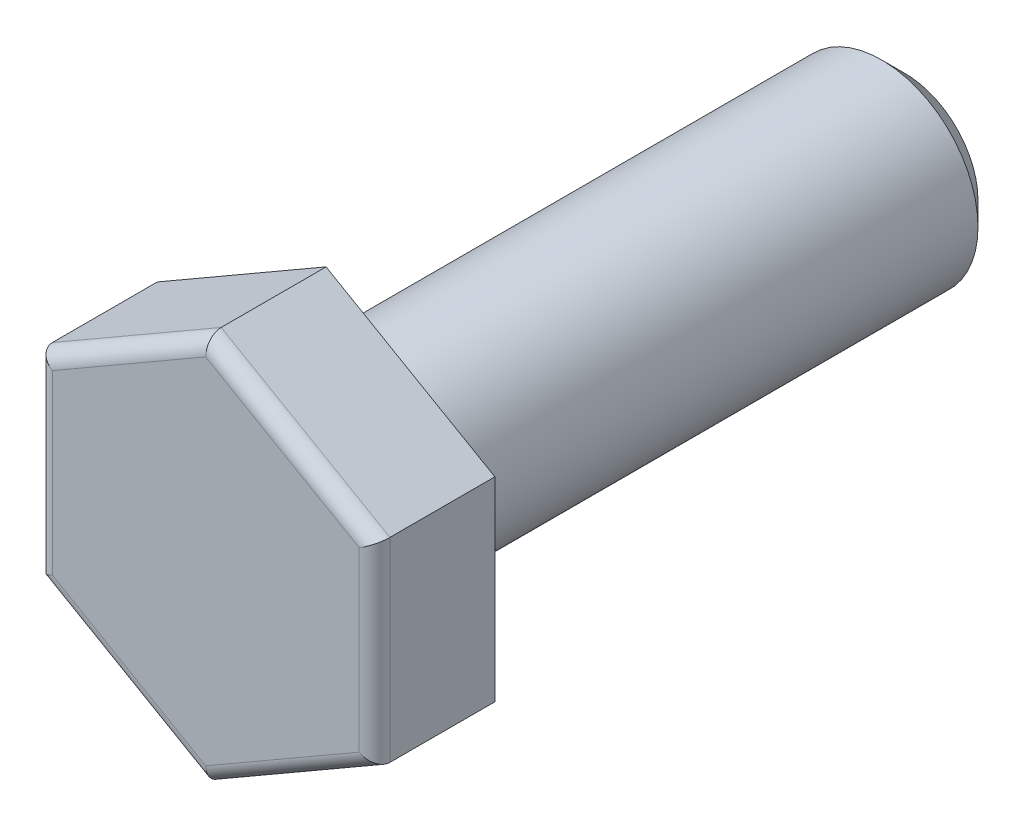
ISO-10303-21;
HEADER;
FILE_DESCRIPTION(('STEP AP214'),'2;1');
FILE_NAME('part.step','',(''),(''),'','','');
FILE_SCHEMA(('AUTOMOTIVE_DESIGN { 1 0 10303 214 1 1 1 1 }'));
ENDSEC;
DATA;
#1=APPLICATION_CONTEXT('core data for automotive mechanical design processes');
#2=APPLICATION_PROTOCOL_DEFINITION('international standard','automotive_design',2000,#1);
#3=PRODUCT_CONTEXT('',#1,'mechanical');
#4=PRODUCT('Part','Part','',(#3));
#5=PRODUCT_RELATED_PRODUCT_CATEGORY('part','',(#4));
#6=PRODUCT_DEFINITION_FORMATION('','',#4);
#7=PRODUCT_DEFINITION_CONTEXT('part definition',#1,'design');
#8=PRODUCT_DEFINITION('design','',#6,#7);
#9=PRODUCT_DEFINITION_SHAPE('','',#8);
#10=(LENGTH_UNIT() NAMED_UNIT(*) SI_UNIT(.MILLI.,.METRE.));
#11=(NAMED_UNIT(*) PLANE_ANGLE_UNIT() SI_UNIT($,.RADIAN.));
#12=(NAMED_UNIT(*) SI_UNIT($,.STERADIAN.) SOLID_ANGLE_UNIT());
#13=UNCERTAINTY_MEASURE_WITH_UNIT(LENGTH_MEASURE(1.E-05),#10,'distance_accuracy_value','');
#14=(GEOMETRIC_REPRESENTATION_CONTEXT(3) GLOBAL_UNCERTAINTY_ASSIGNED_CONTEXT((#13)) GLOBAL_UNIT_ASSIGNED_CONTEXT((#10,
#11,#12)) REPRESENTATION_CONTEXT('',''));
#15=CARTESIAN_POINT('',(0.,0.,0.));
#16=DIRECTION('',(0.,0.,1.));
#17=DIRECTION('',(1.,0.,0.));
#18=AXIS2_PLACEMENT_3D('',#15,#16,#17);
#19=CARTESIAN_POINT('',(5.55625000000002,-3.20790243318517,0.));
#20=DIRECTION('',(0.,0.,-0.999999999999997));
#21=DIRECTION('',(-1.,0.,0.));
#22=AXIS2_PLACEMENT_3D('',#19,#20,#21);
#23=PLANE('',#22);
#24=DIRECTION('',(0.,1.,0.));
#25=VECTOR('',#24,1.);
#26=CARTESIAN_POINT('',(5.55625000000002,-3.20790243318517,0.));
#27=LINE('',#26,#25);
#28=CARTESIAN_POINT('',(5.55625000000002,-3.20790243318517,0.));
#29=VERTEX_POINT('',#28);
#30=CARTESIAN_POINT('',(5.55624999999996,3.20790243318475,0.));
#31=VERTEX_POINT('',#30);
#32=EDGE_CURVE('E113',#29,#31,#27,.T.);
#33=ORIENTED_EDGE('',*,*,#32,.F.);
#34=DIRECTION('',(0.86602540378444,0.5,0.));
#35=VECTOR('',#34,1.);
#36=CARTESIAN_POINT('',(1.11022302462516E-13,-6.41580486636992,0.));
#37=LINE('',#36,#35);
#38=CARTESIAN_POINT('',(1.11022302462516E-13,-6.41580486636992,0.));
#39=VERTEX_POINT('',#38);
#40=EDGE_CURVE('E135',#39,#29,#37,.T.);
#41=ORIENTED_EDGE('',*,*,#40,.F.);
#42=DIRECTION('',(0.86602540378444,-0.5,0.));
#43=VECTOR('',#42,1.);
#44=CARTESIAN_POINT('',(-5.5562499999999,-3.20790243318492,0.));
#45=LINE('',#44,#43);
#46=CARTESIAN_POINT('',(-5.5562499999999,-3.20790243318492,0.));
#47=VERTEX_POINT('',#46);
#48=EDGE_CURVE('E132',#47,#39,#45,.T.);
#49=ORIENTED_EDGE('',*,*,#48,.F.);
#50=DIRECTION('',(0.,-1.,0.));
#51=VECTOR('',#50,1.);
#52=CARTESIAN_POINT('',(-5.55625000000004,3.20790243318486,0.));
#53=LINE('',#52,#51);
#54=CARTESIAN_POINT('',(-5.55625000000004,3.20790243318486,0.));
#55=VERTEX_POINT('',#54);
#56=EDGE_CURVE('E129',#55,#47,#53,.T.);
#57=ORIENTED_EDGE('',*,*,#56,.F.);
#58=DIRECTION('',(-0.866025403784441,-0.500000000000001,0.));
#59=VECTOR('',#58,1.);
#60=CARTESIAN_POINT('',(0.,6.41580486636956,0.));
#61=LINE('',#60,#59);
#62=CARTESIAN_POINT('',(0.,6.41580486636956,0.));
#63=VERTEX_POINT('',#62);
#64=EDGE_CURVE('E116',#63,#55,#61,.T.);
#65=ORIENTED_EDGE('',*,*,#64,.F.);
#66=DIRECTION('',(-0.86602540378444,0.5,0.));
#67=VECTOR('',#66,1.);
#68=CARTESIAN_POINT('',(5.55624999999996,3.20790243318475,0.));
#69=LINE('',#68,#67);
#70=EDGE_CURVE('E101',#31,#63,#69,.T.);
#71=ORIENTED_EDGE('',*,*,#70,.F.);
#72=EDGE_LOOP('',(#33,#41,#49,#57,#65,#71));
#73=FACE_BOUND('',#72,.T.);
#74=CARTESIAN_POINT('',(0.,0.,0.));
#75=DIRECTION('',(0.,0.,-0.999999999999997));
#76=DIRECTION('',(-1.,0.,0.));
#77=AXIS2_PLACEMENT_3D('',#74,#75,#76);
#78=CIRCLE('',#77,3.175);
#79=CARTESIAN_POINT('',(3.17499999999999,0.,0.));
#80=VERTEX_POINT('',#79);
#81=EDGE_CURVE('E121',#80,#80,#78,.T.);
#82=ORIENTED_EDGE('',*,*,#81,.F.);
#83=EDGE_LOOP('',(#82));
#84=FACE_BOUND('',#83,.T.);
#85=ADVANCED_FACE('F30',(#73,#84),#23,.T.);
#86=CARTESIAN_POINT('',(5.55624999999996,-3.20790243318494,3.96239999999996));
#87=DIRECTION('',(-1.,0.,0.));
#88=DIRECTION('',(0.,-1.,0.));
#89=AXIS2_PLACEMENT_3D('',#86,#87,#88);
#90=PLANE('',#89);
#91=DIRECTION('',(0.,0.,-0.999999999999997));
#92=VECTOR('',#91,1.);
#93=CARTESIAN_POINT('',(5.55624999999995,3.20790243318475,3.96239999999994));
#94=LINE('',#93,#92);
#95=CARTESIAN_POINT('',(5.55624999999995,3.20790243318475,3.45439999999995));
#96=VERTEX_POINT('',#95);
#97=EDGE_CURVE('E98',#96,#31,#94,.T.);
#98=ORIENTED_EDGE('',*,*,#97,.F.);
#99=DIRECTION('',(0.,1.,0.));
#100=VECTOR('',#99,1.);
#101=CARTESIAN_POINT('',(5.55624999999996,-3.20790243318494,3.45439999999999));
#102=LINE('',#101,#100);
#103=CARTESIAN_POINT('',(5.55624999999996,-3.20790243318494,3.45439999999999));
#104=VERTEX_POINT('',#103);
#105=EDGE_CURVE('E11',#96,#104,#102,.F.);
#106=ORIENTED_EDGE('',*,*,#105,.T.);
#107=DIRECTION('',(0.,0.,-0.999999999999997));
#108=VECTOR('',#107,1.);
#109=CARTESIAN_POINT('',(5.55624999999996,-3.20790243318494,3.96239999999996));
#110=LINE('',#109,#108);
#111=EDGE_CURVE('E119',#104,#29,#110,.T.);
#112=ORIENTED_EDGE('',*,*,#111,.T.);
#113=ORIENTED_EDGE('',*,*,#32,.T.);
#114=EDGE_LOOP('',(#98,#106,#112,#113));
#115=FACE_BOUND('',#114,.T.);
#116=ADVANCED_FACE('F32',(#115),#90,.F.);
#117=CARTESIAN_POINT('',(5.55624999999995,3.20790243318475,3.96239999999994));
#118=DIRECTION('',(-0.500000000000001,-0.86602540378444,0.));
#119=DIRECTION('',(0.86602540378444,-0.500000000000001,0.));
#120=AXIS2_PLACEMENT_3D('',#117,#118,#119);
#121=PLANE('',#120);
#122=DIRECTION('',(0.,0.,-0.999999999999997));
#123=VECTOR('',#122,1.);
#124=CARTESIAN_POINT('',(-2.28983498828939E-13,6.41580486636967,3.96239999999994));
#125=LINE('',#124,#123);
#126=CARTESIAN_POINT('',(-2.28983498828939E-13,6.41580486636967,3.45439999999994));
#127=VERTEX_POINT('',#126);
#128=EDGE_CURVE('E107',#127,#63,#125,.T.);
#129=ORIENTED_EDGE('',*,*,#128,.F.);
#130=DIRECTION('',(-0.86602540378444,0.500000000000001,0.));
#131=VECTOR('',#130,1.);
#132=CARTESIAN_POINT('',(5.55624999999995,3.20790243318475,3.45439999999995));
#133=LINE('',#132,#131);
#134=EDGE_CURVE('E38',#127,#96,#133,.F.);
#135=ORIENTED_EDGE('',*,*,#134,.T.);
#136=ORIENTED_EDGE('',*,*,#97,.T.);
#137=ORIENTED_EDGE('',*,*,#70,.T.);
#138=EDGE_LOOP('',(#129,#135,#136,#137));
#139=FACE_BOUND('',#138,.T.);
#140=ADVANCED_FACE('F100',(#139),#121,.F.);
#141=CARTESIAN_POINT('',(-2.28983498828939E-13,6.41580486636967,3.96239999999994));
#142=DIRECTION('',(0.500000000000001,-0.866025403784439,0.));
#143=DIRECTION('',(0.86602540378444,0.500000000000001,0.));
#144=AXIS2_PLACEMENT_3D('',#141,#142,#143);
#145=PLANE('',#144);
#146=DIRECTION('',(0.,0.,-0.999999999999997));
#147=VECTOR('',#146,1.);
#148=CARTESIAN_POINT('',(-5.55624999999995,3.20790243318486,3.96239999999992));
#149=LINE('',#148,#147);
#150=CARTESIAN_POINT('',(-5.55624999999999,3.20790243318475,3.45439999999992));
#151=VERTEX_POINT('',#150);
#152=EDGE_CURVE('E142',#151,#55,#149,.T.);
#153=ORIENTED_EDGE('',*,*,#152,.F.);
#154=DIRECTION('',(-0.86602540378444,-0.500000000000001,0.));
#155=VECTOR('',#154,1.);
#156=CARTESIAN_POINT('',(-2.28983498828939E-13,6.41580486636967,3.45439999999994));
#157=LINE('',#156,#155);
#158=EDGE_CURVE('E52',#151,#127,#157,.F.);
#159=ORIENTED_EDGE('',*,*,#158,.T.);
#160=ORIENTED_EDGE('',*,*,#128,.T.);
#161=ORIENTED_EDGE('',*,*,#64,.T.);
#162=EDGE_LOOP('',(#153,#159,#160,#161));
#163=FACE_BOUND('',#162,.T.);
#164=ADVANCED_FACE('F178',(#163),#145,.F.);
#165=CARTESIAN_POINT('',(-5.55624999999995,3.20790243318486,3.96239999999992));
#166=DIRECTION('',(1.,0.,0.));
#167=DIRECTION('',(0.,1.,0.));
#168=AXIS2_PLACEMENT_3D('',#165,#166,#167);
#169=PLANE('',#168);
#170=DIRECTION('',(0.,0.,-0.999999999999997));
#171=VECTOR('',#170,1.);
#172=CARTESIAN_POINT('',(-5.55625000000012,-3.20790243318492,3.96239999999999));
#173=LINE('',#172,#171);
#174=CARTESIAN_POINT('',(-5.55625000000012,-3.20790243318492,3.4544));
#175=VERTEX_POINT('',#174);
#176=EDGE_CURVE('E140',#175,#47,#173,.T.);
#177=ORIENTED_EDGE('',*,*,#176,.F.);
#178=DIRECTION('',(0.,-1.,0.));
#179=VECTOR('',#178,1.);
#180=CARTESIAN_POINT('',(-5.55624999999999,3.20790243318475,3.45439999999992));
#181=LINE('',#180,#179);
#182=EDGE_CURVE('E168',#175,#151,#181,.F.);
#183=ORIENTED_EDGE('',*,*,#182,.T.);
#184=ORIENTED_EDGE('',*,*,#152,.T.);
#185=ORIENTED_EDGE('',*,*,#56,.T.);
#186=EDGE_LOOP('',(#177,#183,#184,#185));
#187=FACE_BOUND('',#186,.T.);
#188=ADVANCED_FACE('F173',(#187),#169,.F.);
#189=CARTESIAN_POINT('',(-5.55625000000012,-3.20790243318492,3.96239999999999));
#190=DIRECTION('',(0.499999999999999,0.866025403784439,0.));
#191=DIRECTION('',(-0.866025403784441,0.5,0.));
#192=AXIS2_PLACEMENT_3D('',#189,#190,#191);
#193=PLANE('',#192);
#194=DIRECTION('',(0.,0.,-0.999999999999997));
#195=VECTOR('',#194,1.);
#196=CARTESIAN_POINT('',(-1.87350135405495E-13,-6.41580486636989,3.96239999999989));
#197=LINE('',#196,#195);
#198=CARTESIAN_POINT('',(-1.87350135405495E-13,-6.41580486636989,3.45439999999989));
#199=VERTEX_POINT('',#198);
#200=EDGE_CURVE('E138',#199,#39,#197,.T.);
#201=ORIENTED_EDGE('',*,*,#200,.F.);
#202=DIRECTION('',(0.866025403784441,-0.5,0.));
#203=VECTOR('',#202,1.);
#204=CARTESIAN_POINT('',(-5.55625000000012,-3.20790243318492,3.4544));
#205=LINE('',#204,#203);
#206=EDGE_CURVE('E166',#199,#175,#205,.F.);
#207=ORIENTED_EDGE('',*,*,#206,.T.);
#208=ORIENTED_EDGE('',*,*,#176,.T.);
#209=ORIENTED_EDGE('',*,*,#48,.T.);
#210=EDGE_LOOP('',(#201,#207,#208,#209));
#211=FACE_BOUND('',#210,.T.);
#212=ADVANCED_FACE('F219',(#211),#193,.F.);
#213=CARTESIAN_POINT('',(-1.87350135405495E-13,-6.41580486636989,3.96239999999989));
#214=DIRECTION('',(-0.5,0.866025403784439,0.));
#215=DIRECTION('',(-0.866025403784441,-0.500000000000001,0.));
#216=AXIS2_PLACEMENT_3D('',#213,#214,#215);
#217=PLANE('',#216);
#218=ORIENTED_EDGE('',*,*,#111,.F.);
#219=DIRECTION('',(0.866025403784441,0.500000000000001,0.));
#220=VECTOR('',#219,1.);
#221=CARTESIAN_POINT('',(-1.87350135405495E-13,-6.41580486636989,3.45439999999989));
#222=LINE('',#221,#220);
#223=EDGE_CURVE('E163',#104,#199,#222,.F.);
#224=ORIENTED_EDGE('',*,*,#223,.T.);
#225=ORIENTED_EDGE('',*,*,#200,.T.);
#226=ORIENTED_EDGE('',*,*,#40,.T.);
#227=EDGE_LOOP('',(#218,#224,#225,#226));
#228=FACE_BOUND('',#227,.T.);
#229=ADVANCED_FACE('F218',(#228),#217,.F.);
#230=CARTESIAN_POINT('',(5.55624999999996,-3.20790243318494,3.96239999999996));
#231=DIRECTION('',(0.,0.,-0.999999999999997));
#232=DIRECTION('',(-1.,0.,0.));
#233=AXIS2_PLACEMENT_3D('',#230,#231,#232);
#234=PLANE('',#233);
#235=DIRECTION('',(0.866025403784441,-0.5,0.));
#236=VECTOR('',#235,1.);
#237=CARTESIAN_POINT('',(3.03212499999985,-7.57981517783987,3.96239999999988));
#238=LINE('',#237,#236);
#239=CARTESIAN_POINT('',(-5.04825000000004,-2.9146084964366,3.9624));
#240=VERTEX_POINT('',#239);
#241=CARTESIAN_POINT('',(0.,-5.82921699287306,3.96239999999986));
#242=VERTEX_POINT('',#241);
#243=EDGE_CURVE('E158',#240,#242,#238,.T.);
#244=ORIENTED_EDGE('',*,*,#243,.T.);
#245=DIRECTION('',(0.866025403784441,0.500000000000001,0.));
#246=VECTOR('',#245,1.);
#247=CARTESIAN_POINT('',(5.30225000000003,-2.76796152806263,3.9624));
#248=LINE('',#247,#246);
#249=CARTESIAN_POINT('',(5.04824999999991,-2.91460849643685,3.96239999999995));
#250=VERTEX_POINT('',#249);
#251=EDGE_CURVE('E160',#242,#250,#248,.T.);
#252=ORIENTED_EDGE('',*,*,#251,.T.);
#253=DIRECTION('',(0.,1.,0.));
#254=VECTOR('',#253,1.);
#255=CARTESIAN_POINT('',(5.04824999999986,-3.20790243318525,3.96239999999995));
#256=LINE('',#255,#254);
#257=CARTESIAN_POINT('',(5.04824999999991,2.91460849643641,3.96239999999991));
#258=VERTEX_POINT('',#257);
#259=EDGE_CURVE('E150',#250,#258,#256,.T.);
#260=ORIENTED_EDGE('',*,*,#259,.T.);
#261=DIRECTION('',(-0.86602540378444,0.500000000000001,0.));
#262=VECTOR('',#261,1.);
#263=CARTESIAN_POINT('',(8.08037500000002,1.16401031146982,3.96239999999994));
#264=LINE('',#263,#262);
#265=CARTESIAN_POINT('',(0.,5.82921699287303,3.96239999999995));
#266=VERTEX_POINT('',#265);
#267=EDGE_CURVE('E152',#258,#266,#264,.T.);
#268=ORIENTED_EDGE('',*,*,#267,.T.);
#269=DIRECTION('',(-0.86602540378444,-0.500000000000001,0.));
#270=VECTOR('',#269,1.);
#271=CARTESIAN_POINT('',(0.253999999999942,5.97586396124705,3.96239999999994));
#272=LINE('',#271,#270);
#273=CARTESIAN_POINT('',(-5.04825,2.91460849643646,3.96239999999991));
#274=VERTEX_POINT('',#273);
#275=EDGE_CURVE('E154',#266,#274,#272,.T.);
#276=ORIENTED_EDGE('',*,*,#275,.T.);
#277=DIRECTION('',(0.,-1.,0.));
#278=VECTOR('',#277,1.);
#279=CARTESIAN_POINT('',(-5.04825000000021,-3.20790243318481,3.96239999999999));
#280=LINE('',#279,#278);
#281=EDGE_CURVE('E156',#274,#240,#280,.T.);
#282=ORIENTED_EDGE('',*,*,#281,.T.);
#283=EDGE_LOOP('',(#244,#252,#260,#268,#276,#282));
#284=FACE_BOUND('',#283,.T.);
#285=ADVANCED_FACE('F209',(#284),#234,.F.);
#286=CARTESIAN_POINT('',(0.,-1.11022302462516E-13,-19.0499999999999));
#287=DIRECTION('',(0.,0.,0.999999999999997));
#288=DIRECTION('',(1.,0.,0.));
#289=AXIS2_PLACEMENT_3D('',#286,#287,#288);
#290=CYLINDRICAL_SURFACE('',#289,3.175);
#291=CARTESIAN_POINT('',(0.,-1.11022302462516E-13,-18.2879999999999));
#292=DIRECTION('',(0.,0.,-0.999999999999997));
#293=DIRECTION('',(-1.,0.,0.));
#294=AXIS2_PLACEMENT_3D('',#291,#292,#293);
#295=CIRCLE('',#294,3.175);
#296=CARTESIAN_POINT('',(3.17499999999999,-1.10316068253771E-13,-18.2879999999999));
#297=VERTEX_POINT('',#296);
#298=EDGE_CURVE('E147',#297,#297,#295,.F.);
#299=CARTESIAN_POINT('',(3.17499999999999,-1.10316068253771E-13,-18.2879999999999));
#300=CARTESIAN_POINT('',(3.17499999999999,-1.10051385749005E-13,-18.0974999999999));
#301=CARTESIAN_POINT('',(3.17499999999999,-1.09786703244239E-13,-17.9069999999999));
#302=CARTESIAN_POINT('',(3.17499999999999,-1.09257338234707E-13,-17.5259999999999));
#303=CARTESIAN_POINT('',(3.17499999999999,-1.08992655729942E-13,-17.3354999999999));
#304=CARTESIAN_POINT('',(3.17499999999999,-1.0846329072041E-13,-16.9544999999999));
#305=CARTESIAN_POINT('',(3.17499999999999,-1.08198608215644E-13,-16.7639999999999));
#306=CARTESIAN_POINT('',(3.17499999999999,-1.07669243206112E-13,-16.3829999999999));
#307=CARTESIAN_POINT('',(3.17499999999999,-1.07404560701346E-13,-16.1924999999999));
#308=CARTESIAN_POINT('',(3.17499999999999,-1.06875195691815E-13,-15.8114999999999));
#309=CARTESIAN_POINT('',(3.17499999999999,-1.06610513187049E-13,-15.6209999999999));
#310=CARTESIAN_POINT('',(3.17499999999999,-1.06081148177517E-13,-15.2399999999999));
#311=CARTESIAN_POINT('',(3.17499999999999,-1.05816465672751E-13,-15.0494999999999));
#312=CARTESIAN_POINT('',(3.17499999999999,-1.0528710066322E-13,-14.6684999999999));
#313=CARTESIAN_POINT('',(3.17499999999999,-1.05022418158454E-13,-14.478));
#314=CARTESIAN_POINT('',(3.17499999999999,-1.04493053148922E-13,-14.097));
#315=CARTESIAN_POINT('',(3.17499999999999,-1.04228370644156E-13,-13.9065));
#316=CARTESIAN_POINT('',(3.17499999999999,-1.03699005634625E-13,-13.5255));
#317=CARTESIAN_POINT('',(3.17499999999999,-1.03434323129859E-13,-13.335));
#318=CARTESIAN_POINT('',(3.17499999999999,-1.02904958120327E-13,-12.954));
#319=CARTESIAN_POINT('',(3.17499999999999,-1.02640275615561E-13,-12.7635));
#320=CARTESIAN_POINT('',(3.17499999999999,-1.0211091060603E-13,-12.3825));
#321=CARTESIAN_POINT('',(3.17499999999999,-1.01846228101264E-13,-12.192));
#322=CARTESIAN_POINT('',(3.17499999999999,-1.01316863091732E-13,-11.811));
#323=CARTESIAN_POINT('',(3.17499999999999,-1.01052180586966E-13,-11.6205));
#324=CARTESIAN_POINT('',(3.17499999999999,-1.00522815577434E-13,-11.2395));
#325=CARTESIAN_POINT('',(3.17499999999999,-1.00258133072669E-13,-11.049));
#326=CARTESIAN_POINT('',(3.17499999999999,0.,-10.668));
#327=CARTESIAN_POINT('',(3.17499999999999,0.,-10.4775));
#328=CARTESIAN_POINT('',(3.17499999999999,0.,-10.0965));
#329=CARTESIAN_POINT('',(3.17499999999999,0.,-9.90599999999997));
#330=CARTESIAN_POINT('',(3.17499999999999,0.,-9.52499999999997));
#331=CARTESIAN_POINT('',(3.17499999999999,0.,-9.33449999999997));
#332=CARTESIAN_POINT('',(3.17499999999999,0.,-8.95349999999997));
#333=CARTESIAN_POINT('',(3.17499999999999,0.,-8.76299999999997));
#334=CARTESIAN_POINT('',(3.17499999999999,0.,-8.38199999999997));
#335=CARTESIAN_POINT('',(3.17499999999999,0.,-8.19149999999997));
#336=CARTESIAN_POINT('',(3.17499999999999,0.,-7.81049999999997));
#337=CARTESIAN_POINT('',(3.17499999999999,0.,-7.61999999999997));
#338=CARTESIAN_POINT('',(3.17499999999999,0.,-7.23899999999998));
#339=CARTESIAN_POINT('',(3.17499999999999,0.,-7.04849999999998));
#340=CARTESIAN_POINT('',(3.17499999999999,0.,-6.66749999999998));
#341=CARTESIAN_POINT('',(3.17499999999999,0.,-6.47699999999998));
#342=CARTESIAN_POINT('',(3.17499999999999,0.,-6.09599999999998));
#343=CARTESIAN_POINT('',(3.17499999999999,0.,-5.90549999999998));
#344=CARTESIAN_POINT('',(3.17499999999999,0.,-5.52449999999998));
#345=CARTESIAN_POINT('',(3.17499999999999,0.,-5.33399999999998));
#346=CARTESIAN_POINT('',(3.17499999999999,0.,-4.95299999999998));
#347=CARTESIAN_POINT('',(3.17499999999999,0.,-4.76249999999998));
#348=CARTESIAN_POINT('',(3.17499999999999,0.,-4.38149999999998));
#349=CARTESIAN_POINT('',(3.17499999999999,0.,-4.19099999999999));
#350=CARTESIAN_POINT('',(3.17499999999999,0.,-3.80999999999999));
#351=CARTESIAN_POINT('',(3.17499999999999,0.,-3.61949999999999));
#352=CARTESIAN_POINT('',(3.17499999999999,0.,-3.23849999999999));
#353=CARTESIAN_POINT('',(3.17499999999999,0.,-3.04799999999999));
#354=CARTESIAN_POINT('',(3.17499999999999,0.,-2.66699999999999));
#355=CARTESIAN_POINT('',(3.17499999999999,0.,-2.47649999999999));
#356=CARTESIAN_POINT('',(3.17499999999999,0.,-2.09549999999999));
#357=CARTESIAN_POINT('',(3.17499999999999,0.,-1.90499999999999));
#358=CARTESIAN_POINT('',(3.17499999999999,0.,-1.52399999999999));
#359=CARTESIAN_POINT('',(3.17499999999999,0.,-1.33349999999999));
#360=CARTESIAN_POINT('',(3.17499999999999,0.,-0.952499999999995));
#361=CARTESIAN_POINT('',(3.17499999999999,0.,-0.761999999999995));
#362=CARTESIAN_POINT('',(3.17499999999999,0.,-0.380999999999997));
#363=CARTESIAN_POINT('',(3.17499999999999,0.,-0.190499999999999));
#364=CARTESIAN_POINT('',(3.17499999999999,0.,0.));
#365=B_SPLINE_CURVE_WITH_KNOTS('',3,(#299,#300,#301,#302,#303,#304,#305,#306,#307,#308,#309,
#310,#311,#312,#313,#314,#315,#316,#317,#318,#319,#320,#321,#322,#323,#324,#325,#326,#327,#328,
#329,#330,#331,#332,#333,#334,#335,#336,#337,#338,#339,#340,#341,#342,#343,#344,#345,#346,#347,
#348,#349,#350,#351,#352,#353,#354,#355,#356,#357,#358,#359,#360,#361,#362,#363,#364),
.UNSPECIFIED.,.F.,.F.,(4,2,2,2,2,2,2,2,2,2,2,2,2,2,2,2,2,2,2,2,2,2,2,2,2,2,2,2,2,2,2,2,4),(0.,
0.571499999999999,1.143,1.7145,2.28599999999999,2.85749999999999,3.42899999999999,
4.00049999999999,4.57199999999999,5.14349999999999,5.71499999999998,6.28649999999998,
6.85799999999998,7.42949999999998,8.00099999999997,8.57249999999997,9.14399999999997,
9.71549999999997,10.287,10.8585,11.43,12.0015,12.573,13.1445,13.716,14.2875,14.859,15.4305,
16.0019999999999,16.5734999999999,17.1449999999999,17.7164999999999,18.2879999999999),.UNSPECIFIED.);
#366=EDGE_CURVE('BSEAM236',#297,#80,#365,.T.);
#367=ORIENTED_EDGE('',*,*,#298,.T.);
#368=ORIENTED_EDGE('',*,*,#81,.T.);
#369=ORIENTED_EDGE('',*,*,#366,.T.);
#370=ORIENTED_EDGE('',*,*,#366,.F.);
#371=EDGE_LOOP('',(#367,#369,#368,#370));
#372=FACE_BOUND('',#371,.T.);
#373=ADVANCED_FACE('F236',(#372),#290,.T.);
#374=CARTESIAN_POINT('',(0.,-1.11022302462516E-13,-19.0499999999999));
#375=DIRECTION('',(0.,0.,-0.999999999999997));
#376=DIRECTION('',(-1.,0.,0.));
#377=AXIS2_PLACEMENT_3D('',#374,#375,#376);
#378=PLANE('',#377);
#379=CARTESIAN_POINT('',(0.,-1.11022302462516E-13,-19.0499999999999));
#380=DIRECTION('',(0.,0.,-0.999999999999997));
#381=DIRECTION('',(-1.,0.,0.));
#382=AXIS2_PLACEMENT_3D('',#379,#380,#381);
#383=CIRCLE('',#382,2.413);
#384=CARTESIAN_POINT('',(2.41299999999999,-1.11290199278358E-13,-19.0499999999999));
#385=VERTEX_POINT('',#384);
#386=EDGE_CURVE('E106',#385,#385,#383,.T.);
#387=ORIENTED_EDGE('',*,*,#386,.T.);
#388=EDGE_LOOP('',(#387));
#389=FACE_BOUND('',#388,.T.);
#390=ADVANCED_FACE('F242',(#389),#378,.T.);
#391=CARTESIAN_POINT('',(0.,-1.11022302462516E-13,-19.0499999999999));
#392=DIRECTION('',(0.,0.,0.999999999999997));
#393=DIRECTION('',(1.,0.,0.));
#394=AXIS2_PLACEMENT_3D('',#391,#392,#393);
#395=CONICAL_SURFACE('',#394,2.413,0.785398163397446);
#396=CARTESIAN_POINT('',(3.17499999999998,-1.10316068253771E-13,-18.2879999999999));
#397=CARTESIAN_POINT('',(3.16706249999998,-1.10326215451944E-13,-18.2959374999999));
#398=CARTESIAN_POINT('',(3.15912499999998,-1.10336362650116E-13,-18.3038749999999));
#399=CARTESIAN_POINT('',(3.14324999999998,-1.10356657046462E-13,-18.3197499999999));
#400=CARTESIAN_POINT('',(3.13531249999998,-1.10366804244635E-13,-18.3276874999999));
#401=CARTESIAN_POINT('',(3.11943749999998,-1.1038709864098E-13,-18.3435624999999));
#402=CARTESIAN_POINT('',(3.11149999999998,-1.10397245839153E-13,-18.3514999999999));
#403=CARTESIAN_POINT('',(3.09562499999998,-1.10417540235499E-13,-18.3673749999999));
#404=CARTESIAN_POINT('',(3.08768749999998,-1.10427687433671E-13,-18.3753124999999));
#405=CARTESIAN_POINT('',(3.07181249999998,-1.10447981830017E-13,-18.3911874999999));
#406=CARTESIAN_POINT('',(3.06387499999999,-1.1045812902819E-13,-18.3991249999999));
#407=CARTESIAN_POINT('',(3.04799999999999,-1.10478423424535E-13,-18.4149999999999));
#408=CARTESIAN_POINT('',(3.04006249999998,-1.10488570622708E-13,-18.4229374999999));
#409=CARTESIAN_POINT('',(3.02418749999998,-1.10508865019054E-13,-18.4388124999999));
#410=CARTESIAN_POINT('',(3.01624999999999,-1.10519012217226E-13,-18.4467499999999));
#411=CARTESIAN_POINT('',(3.00037499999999,-1.10539306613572E-13,-18.4626249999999));
#412=CARTESIAN_POINT('',(2.99243749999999,-1.10549453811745E-13,-18.4705624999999));
#413=CARTESIAN_POINT('',(2.97656249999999,-1.1056974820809E-13,-18.4864374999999));
#414=CARTESIAN_POINT('',(2.96862499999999,-1.10579895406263E-13,-18.4943749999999));
#415=CARTESIAN_POINT('',(2.95274999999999,-1.10600189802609E-13,-18.5102499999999));
#416=CARTESIAN_POINT('',(2.94481249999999,-1.10610337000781E-13,-18.5181874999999));
#417=CARTESIAN_POINT('',(2.92893749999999,-1.10630631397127E-13,-18.5340624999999));
#418=CARTESIAN_POINT('',(2.92099999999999,-1.106407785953E-13,-18.5419999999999));
#419=CARTESIAN_POINT('',(2.90512499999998,-1.10661072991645E-13,-18.5578749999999));
#420=CARTESIAN_POINT('',(2.89718749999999,-1.10671220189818E-13,-18.5658124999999));
#421=CARTESIAN_POINT('',(2.88131249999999,-1.10691514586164E-13,-18.5816874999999));
#422=CARTESIAN_POINT('',(2.87337499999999,-1.10701661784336E-13,-18.5896249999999));
#423=CARTESIAN_POINT('',(2.85749999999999,-1.10721956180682E-13,-18.6054999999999));
#424=CARTESIAN_POINT('',(2.84956249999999,-1.10732103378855E-13,-18.6134374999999));
#425=CARTESIAN_POINT('',(2.83368749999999,-1.107523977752E-13,-18.6293124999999));
#426=CARTESIAN_POINT('',(2.82574999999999,-1.10762544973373E-13,-18.6372499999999));
#427=CARTESIAN_POINT('',(2.80987499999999,-1.10782839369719E-13,-18.6531249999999));
#428=CARTESIAN_POINT('',(2.80193749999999,-1.10792986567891E-13,-18.6610624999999));
#429=CARTESIAN_POINT('',(2.78606249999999,-1.10813280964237E-13,-18.6769374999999));
#430=CARTESIAN_POINT('',(2.77812499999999,-1.1082342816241E-13,-18.6848749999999));
#431=CARTESIAN_POINT('',(2.76224999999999,-1.10843722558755E-13,-18.7007499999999));
#432=CARTESIAN_POINT('',(2.75431249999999,-1.10853869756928E-13,-18.7086874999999));
#433=CARTESIAN_POINT('',(2.73843749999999,-1.10874164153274E-13,-18.7245624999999));
#434=CARTESIAN_POINT('',(2.73049999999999,-1.10884311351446E-13,-18.7324999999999));
#435=CARTESIAN_POINT('',(2.71462499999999,-1.10904605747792E-13,-18.7483749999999));
#436=CARTESIAN_POINT('',(2.70668749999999,-1.10914752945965E-13,-18.7563124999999));
#437=CARTESIAN_POINT('',(2.69081249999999,-1.1093504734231E-13,-18.7721874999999));
#438=CARTESIAN_POINT('',(2.68287499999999,-1.10945194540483E-13,-18.7801249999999));
#439=CARTESIAN_POINT('',(2.66699999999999,-1.10965488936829E-13,-18.7959999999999));
#440=CARTESIAN_POINT('',(2.65906249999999,-1.10975636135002E-13,-18.8039374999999));
#441=CARTESIAN_POINT('',(2.64318749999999,-1.10995930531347E-13,-18.8198124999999));
#442=CARTESIAN_POINT('',(2.63524999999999,-1.1100607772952E-13,-18.8277499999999));
#443=CARTESIAN_POINT('',(2.61937499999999,-1.11026372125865E-13,-18.8436249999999));
#444=CARTESIAN_POINT('',(2.61143749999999,-1.11036519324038E-13,-18.8515624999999));
#445=CARTESIAN_POINT('',(2.59556249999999,-1.11056813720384E-13,-18.8674374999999));
#446=CARTESIAN_POINT('',(2.58762499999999,-1.11066960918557E-13,-18.8753749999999));
#447=CARTESIAN_POINT('',(2.57174999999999,-1.11087255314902E-13,-18.8912499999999));
#448=CARTESIAN_POINT('',(2.56381249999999,-1.11097402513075E-13,-18.8991874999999));
#449=CARTESIAN_POINT('',(2.54793749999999,-1.1111769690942E-13,-18.9150624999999));
#450=CARTESIAN_POINT('',(2.53999999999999,-1.11127844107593E-13,-18.9229999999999));
#451=CARTESIAN_POINT('',(2.52412499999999,-1.11148138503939E-13,-18.9388749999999));
#452=CARTESIAN_POINT('',(2.51618749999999,-1.11158285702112E-13,-18.9468124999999));
#453=CARTESIAN_POINT('',(2.50031249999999,-1.11178580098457E-13,-18.9626874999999));
#454=CARTESIAN_POINT('',(2.49237499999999,-1.1118872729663E-13,-18.9706249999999));
#455=CARTESIAN_POINT('',(2.47649999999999,-1.11209021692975E-13,-18.9864999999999));
#456=CARTESIAN_POINT('',(2.46856249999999,-1.11219168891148E-13,-18.9944374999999));
#457=CARTESIAN_POINT('',(2.45268749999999,-1.11239463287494E-13,-19.0103124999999));
#458=CARTESIAN_POINT('',(2.44474999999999,-1.11249610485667E-13,-19.0182499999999));
#459=CARTESIAN_POINT('',(2.42887499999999,-1.11269904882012E-13,-19.0341249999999));
#460=CARTESIAN_POINT('',(2.42093749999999,-1.11280052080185E-13,-19.0420624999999));
#461=CARTESIAN_POINT('',(2.41299999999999,-1.11290199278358E-13,-19.0499999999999));
#462=B_SPLINE_CURVE_WITH_KNOTS('',3,(#396,#397,#398,#399,#400,#401,#402,#403,#404,#405,#406,
#407,#408,#409,#410,#411,#412,#413,#414,#415,#416,#417,#418,#419,#420,#421,#422,#423,#424,#425,
#426,#427,#428,#429,#430,#431,#432,#433,#434,#435,#436,#437,#438,#439,#440,#441,#442,#443,#444,
#445,#446,#447,#448,#449,#450,#451,#452,#453,#454,#455,#456,#457,#458,#459,#460,#461),
.UNSPECIFIED.,.F.,.F.,(4,2,2,2,2,2,2,2,2,2,2,2,2,2,2,2,2,2,2,2,2,2,2,2,2,2,2,2,2,2,2,2,4),(0.,
0.0336759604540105,0.0673519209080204,0.101027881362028,0.134703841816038,0.168379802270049,
0.202055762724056,0.235731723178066,0.269407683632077,0.303083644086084,0.336759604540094,
0.370435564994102,0.404111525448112,0.437787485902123,0.47146344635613,0.50513940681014,
0.538815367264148,0.572491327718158,0.606167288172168,0.639843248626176,0.673519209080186,
0.707195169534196,0.740871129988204,0.774547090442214,0.808223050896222,0.841899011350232,
0.875574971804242,0.90925093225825,0.94292689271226,0.97660285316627,1.01027881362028,
1.04395477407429,1.0776307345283),.UNSPECIFIED.);
#463=EDGE_CURVE('BSEAM247',#297,#385,#462,.T.);
#464=ORIENTED_EDGE('',*,*,#298,.F.);
#465=ORIENTED_EDGE('',*,*,#386,.F.);
#466=ORIENTED_EDGE('',*,*,#463,.T.);
#467=ORIENTED_EDGE('',*,*,#463,.F.);
#468=EDGE_LOOP('',(#464,#466,#465,#467));
#469=FACE_BOUND('',#468,.T.);
#470=ADVANCED_FACE('F247',(#469),#395,.T.);
#471=CARTESIAN_POINT('',(0.253999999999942,5.97586396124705,3.45439999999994));
#472=DIRECTION('',(-0.86602540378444,-0.500000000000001,0.));
#473=DIRECTION('',(0.500000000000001,-0.866025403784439,0.));
#474=AXIS2_PLACEMENT_3D('',#471,#472,#473);
#475=CYLINDRICAL_SURFACE('',#474,0.508);
#476=CARTESIAN_POINT('',(0.,5.82921699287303,3.45439999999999));
#477=DIRECTION('',(-1.,0.,0.));
#478=DIRECTION('',(0.,1.,0.));
#479=AXIS2_PLACEMENT_3D('',#476,#477,#478);
#480=ELLIPSE('',#479,0.58658787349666,0.508);
#481=EDGE_CURVE('E186',#127,#266,#480,.F.);
#482=ORIENTED_EDGE('',*,*,#481,.F.);
#483=ORIENTED_EDGE('',*,*,#158,.F.);
#484=CARTESIAN_POINT('',(-5.04825,2.91460849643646,3.45439999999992));
#485=DIRECTION('',(-0.500000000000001,-0.86602540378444,0.));
#486=DIRECTION('',(-0.86602540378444,0.5,0.));
#487=AXIS2_PLACEMENT_3D('',#484,#485,#486);
#488=ELLIPSE('',#487,0.58658787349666,0.508);
#489=EDGE_CURVE('E124',#274,#151,#488,.T.);
#490=ORIENTED_EDGE('',*,*,#489,.F.);
#491=ORIENTED_EDGE('',*,*,#275,.F.);
#492=EDGE_LOOP('',(#482,#483,#490,#491));
#493=FACE_BOUND('',#492,.T.);
#494=ADVANCED_FACE('F182',(#493),#475,.T.);
#495=CARTESIAN_POINT('',(-5.04825000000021,-3.20790243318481,3.4544));
#496=DIRECTION('',(0.,-1.,0.));
#497=DIRECTION('',(1.,0.,0.));
#498=AXIS2_PLACEMENT_3D('',#495,#496,#497);
#499=CYLINDRICAL_SURFACE('',#498,0.508);
#500=ORIENTED_EDGE('',*,*,#489,.T.);
#501=ORIENTED_EDGE('',*,*,#182,.F.);
#502=CARTESIAN_POINT('',(-5.04825000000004,-2.9146084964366,3.4544));
#503=DIRECTION('',(0.500000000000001,-0.866025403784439,0.));
#504=DIRECTION('',(-0.866025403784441,-0.500000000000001,0.));
#505=AXIS2_PLACEMENT_3D('',#502,#503,#504);
#506=ELLIPSE('',#505,0.58658787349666,0.508);
#507=EDGE_CURVE('E188',#240,#175,#506,.T.);
#508=ORIENTED_EDGE('',*,*,#507,.F.);
#509=ORIENTED_EDGE('',*,*,#281,.F.);
#510=EDGE_LOOP('',(#500,#501,#508,#509));
#511=FACE_BOUND('',#510,.T.);
#512=ADVANCED_FACE('F187',(#511),#499,.T.);
#513=CARTESIAN_POINT('',(8.08037500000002,1.16401031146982,3.45439999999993));
#514=DIRECTION('',(-0.86602540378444,0.500000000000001,0.));
#515=DIRECTION('',(-0.500000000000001,-0.86602540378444,0.));
#516=AXIS2_PLACEMENT_3D('',#513,#514,#515);
#517=CYLINDRICAL_SURFACE('',#516,0.508);
#518=ORIENTED_EDGE('',*,*,#481,.T.);
#519=ORIENTED_EDGE('',*,*,#267,.F.);
#520=CARTESIAN_POINT('',(5.04824999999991,2.91460849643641,3.45439999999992));
#521=DIRECTION('',(-0.5,0.866025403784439,0.));
#522=DIRECTION('',(0.86602540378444,0.5,0.));
#523=AXIS2_PLACEMENT_3D('',#520,#521,#522);
#524=ELLIPSE('',#523,0.58658787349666,0.508);
#525=EDGE_CURVE('E192',#96,#258,#524,.F.);
#526=ORIENTED_EDGE('',*,*,#525,.F.);
#527=ORIENTED_EDGE('',*,*,#134,.F.);
#528=EDGE_LOOP('',(#518,#519,#526,#527));
#529=FACE_BOUND('',#528,.T.);
#530=ADVANCED_FACE('F264',(#529),#517,.T.);
#531=CARTESIAN_POINT('',(3.03212499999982,-7.57981517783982,3.45439999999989));
#532=DIRECTION('',(0.866025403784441,-0.5,0.));
#533=DIRECTION('',(0.499999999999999,0.866025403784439,0.));
#534=AXIS2_PLACEMENT_3D('',#531,#532,#533);
#535=CYLINDRICAL_SURFACE('',#534,0.508);
#536=ORIENTED_EDGE('',*,*,#507,.T.);
#537=ORIENTED_EDGE('',*,*,#206,.F.);
#538=CARTESIAN_POINT('',(0.,-5.82921699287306,3.45439999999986));
#539=DIRECTION('',(1.,0.,0.));
#540=DIRECTION('',(0.,-1.,0.));
#541=AXIS2_PLACEMENT_3D('',#538,#539,#540);
#542=ELLIPSE('',#541,0.58658787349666,0.508);
#543=EDGE_CURVE('E195',#242,#199,#542,.T.);
#544=ORIENTED_EDGE('',*,*,#543,.F.);
#545=ORIENTED_EDGE('',*,*,#243,.F.);
#546=EDGE_LOOP('',(#536,#537,#544,#545));
#547=FACE_BOUND('',#546,.T.);
#548=ADVANCED_FACE('F214',(#547),#535,.T.);
#549=CARTESIAN_POINT('',(5.04824999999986,-3.20790243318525,3.45439999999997));
#550=DIRECTION('',(0.,1.,0.));
#551=DIRECTION('',(-1.,0.,0.));
#552=AXIS2_PLACEMENT_3D('',#549,#550,#551);
#553=CYLINDRICAL_SURFACE('',#552,0.508);
#554=ORIENTED_EDGE('',*,*,#525,.T.);
#555=ORIENTED_EDGE('',*,*,#259,.F.);
#556=CARTESIAN_POINT('',(5.04824999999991,-2.91460849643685,3.45439999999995));
#557=DIRECTION('',(0.5,0.866025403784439,0.));
#558=DIRECTION('',(-0.86602540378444,0.5,0.));
#559=AXIS2_PLACEMENT_3D('',#556,#557,#558);
#560=ELLIPSE('',#559,0.58658787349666,0.508);
#561=EDGE_CURVE('E197',#104,#250,#560,.F.);
#562=ORIENTED_EDGE('',*,*,#561,.F.);
#563=ORIENTED_EDGE('',*,*,#105,.F.);
#564=EDGE_LOOP('',(#554,#555,#562,#563));
#565=FACE_BOUND('',#564,.T.);
#566=ADVANCED_FACE('F206',(#565),#553,.T.);
#567=CARTESIAN_POINT('',(5.30225000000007,-2.76796152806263,3.45440000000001));
#568=DIRECTION('',(0.866025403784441,0.500000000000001,0.));
#569=DIRECTION('',(-0.5,0.866025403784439,0.));
#570=AXIS2_PLACEMENT_3D('',#567,#568,#569);
#571=CYLINDRICAL_SURFACE('',#570,0.508);
#572=ORIENTED_EDGE('',*,*,#543,.T.);
#573=ORIENTED_EDGE('',*,*,#223,.F.);
#574=ORIENTED_EDGE('',*,*,#561,.T.);
#575=ORIENTED_EDGE('',*,*,#251,.F.);
#576=EDGE_LOOP('',(#572,#573,#574,#575));
#577=FACE_BOUND('',#576,.T.);
#578=ADVANCED_FACE('F203',(#577),#571,.T.);
#579=CLOSED_SHELL('',(#85,#116,#140,#164,#188,#212,#229,#285,#373,#390,#470,#494,#512,#530,#548,
#566,#578));
#580=MANIFOLD_SOLID_BREP('B2',#579);
#581=ADVANCED_BREP_SHAPE_REPRESENTATION('',(#18,#580),#14);
#582=SHAPE_DEFINITION_REPRESENTATION(#9,#581);
ENDSEC;
END-ISO-10303-21;
